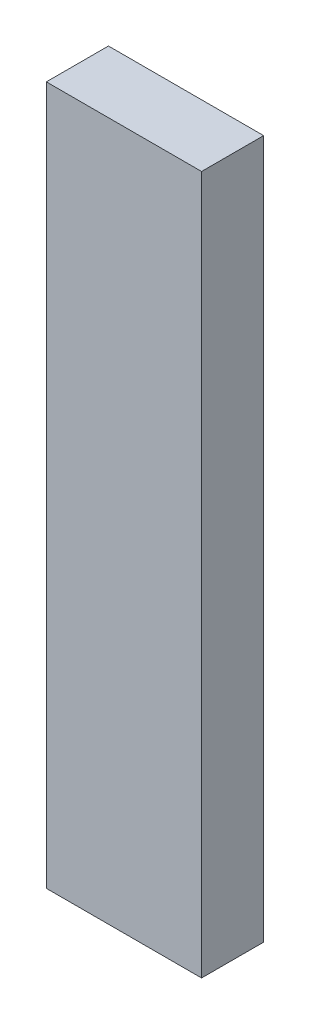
from build123d import *

# Parameters (mm, degrees)
ESQUISSE1_W      = 20
ESQUISSE1_H      = 90
EXTRUSION1_DEPTH = 8


with BuildPart() as part:
    # Esquisse1 → Extrusion1 (new body)
    with BuildSketch(Plane.XY):
        with Locations((10, 45)):
            Rectangle(ESQUISSE1_W, ESQUISSE1_H)
    extrude(amount=EXTRUSION1_DEPTH)


solid = part.part
